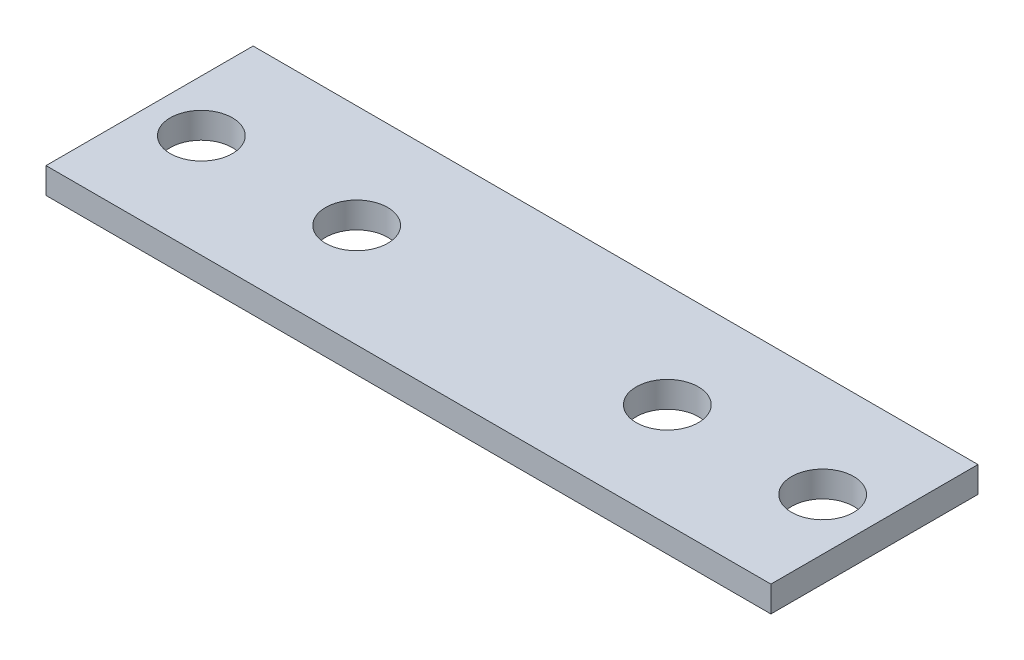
from build123d import *

# Parameters (mm, degrees)
ESQUISSE1_W      = 140
ESQUISSE1_H      = 40
ESQUISSE1_R      = 6
EXTRUSION1_DEPTH = 5


with BuildPart() as part:
    # Esquisse1 → Extrusion1 (new body)
    with BuildSketch(Plane(origin=(0, 0, 0), x_dir=(1, 0, 0), z_dir=(0, 1, 0))):
        with Locations((70, 20)):
            Rectangle(ESQUISSE1_W, ESQUISSE1_H)
        with Locations(Location((10, 20, 0), (0, 0, 270))):
            Circle(ESQUISSE1_R, mode=Mode.SUBTRACT)
        with Locations(Location((130, 20, 0), (0, 0, 270))):
            Circle(ESQUISSE1_R, mode=Mode.SUBTRACT)
        with Locations(Location((40, 20, 0), (0, 0, 270))):
            Circle(ESQUISSE1_R, mode=Mode.SUBTRACT)
        with Locations(Location((100, 20, 0), (0, 0, 270))):
            Circle(ESQUISSE1_R, mode=Mode.SUBTRACT)
    extrude(amount=EXTRUSION1_DEPTH)


solid = part.part
